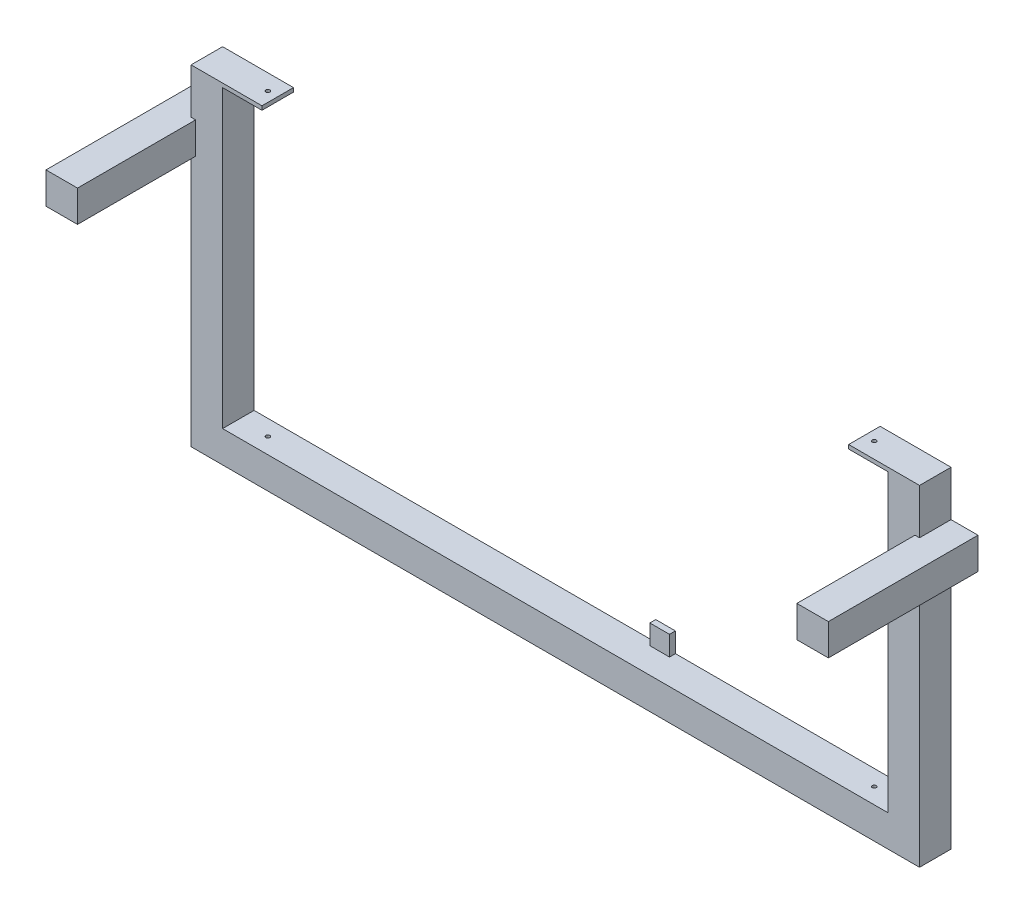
ISO-10303-21;
HEADER;
FILE_DESCRIPTION(('STEP AP214'),'2;1');
FILE_NAME('part.step','',(''),(''),'','','');
FILE_SCHEMA(('AUTOMOTIVE_DESIGN { 1 0 10303 214 1 1 1 1 }'));
ENDSEC;
DATA;
#1=APPLICATION_CONTEXT('core data for automotive mechanical design processes');
#2=APPLICATION_PROTOCOL_DEFINITION('international standard','automotive_design',2000,#1);
#3=PRODUCT_CONTEXT('',#1,'mechanical');
#4=PRODUCT('Part','Part','',(#3));
#5=PRODUCT_RELATED_PRODUCT_CATEGORY('part','',(#4));
#6=PRODUCT_DEFINITION_FORMATION('','',#4);
#7=PRODUCT_DEFINITION_CONTEXT('part definition',#1,'design');
#8=PRODUCT_DEFINITION('design','',#6,#7);
#9=PRODUCT_DEFINITION_SHAPE('','',#8);
#10=(LENGTH_UNIT() NAMED_UNIT(*) SI_UNIT(.MILLI.,.METRE.));
#11=(NAMED_UNIT(*) PLANE_ANGLE_UNIT() SI_UNIT($,.RADIAN.));
#12=(NAMED_UNIT(*) SI_UNIT($,.STERADIAN.) SOLID_ANGLE_UNIT());
#13=UNCERTAINTY_MEASURE_WITH_UNIT(LENGTH_MEASURE(1.E-05),#10,'distance_accuracy_value','');
#14=(GEOMETRIC_REPRESENTATION_CONTEXT(3) GLOBAL_UNCERTAINTY_ASSIGNED_CONTEXT((#13)) GLOBAL_UNIT_ASSIGNED_CONTEXT((#10,
#11,#12)) REPRESENTATION_CONTEXT('',''));
#15=CARTESIAN_POINT('',(0.,0.,0.));
#16=DIRECTION('',(0.,0.,1.));
#17=DIRECTION('',(1.,0.,0.));
#18=AXIS2_PLACEMENT_3D('',#15,#16,#17);
#19=CARTESIAN_POINT('',(-925.,40.0000000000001,40.));
#20=DIRECTION('',(0.,-1.,0.));
#21=DIRECTION('',(0.,0.,-1.));
#22=AXIS2_PLACEMENT_3D('',#19,#20,#21);
#23=PLANE('',#22);
#24=CARTESIAN_POINT('',(770.,40.0000000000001,0.));
#25=DIRECTION('',(0.,-1.,0.));
#26=DIRECTION('',(0.,0.,-1.));
#27=AXIS2_PLACEMENT_3D('',#24,#25,#26);
#28=CIRCLE('',#27,5.00000000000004);
#29=CARTESIAN_POINT('',(770.,40.0000000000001,-5.00000000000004));
#30=VERTEX_POINT('',#29);
#31=EDGE_CURVE('E361',#30,#30,#28,.T.);
#32=ORIENTED_EDGE('',*,*,#31,.T.);
#33=EDGE_LOOP('',(#32));
#34=FACE_BOUND('',#33,.T.);
#35=CARTESIAN_POINT('',(-770.,40.0000000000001,0.));
#36=DIRECTION('',(0.,-1.,0.));
#37=DIRECTION('',(0.,0.,-1.));
#38=AXIS2_PLACEMENT_3D('',#35,#36,#37);
#39=CIRCLE('',#38,5.00000000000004);
#40=CARTESIAN_POINT('',(-770.,40.0000000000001,-5.00000000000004));
#41=VERTEX_POINT('',#40);
#42=EDGE_CURVE('E349',#41,#41,#39,.T.);
#43=ORIENTED_EDGE('',*,*,#42,.T.);
#44=EDGE_LOOP('',(#43));
#45=FACE_BOUND('',#44,.T.);
#46=DIRECTION('',(0.,0.,-1.));
#47=VECTOR('',#46,1.);
#48=CARTESIAN_POINT('',(225.,40.0000000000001,-40.));
#49=LINE('',#48,#47);
#50=CARTESIAN_POINT('',(225.,40.0000000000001,-25.));
#51=VERTEX_POINT('',#50);
#52=CARTESIAN_POINT('',(225.,40.0000000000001,-40.));
#53=VERTEX_POINT('',#52);
#54=EDGE_CURVE('E54',#51,#53,#49,.T.);
#55=ORIENTED_EDGE('',*,*,#54,.F.);
#56=DIRECTION('',(1.,0.,0.));
#57=VECTOR('',#56,1.);
#58=CARTESIAN_POINT('',(225.,40.0000000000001,-25.));
#59=LINE('',#58,#57);
#60=CARTESIAN_POINT('',(175.,40.0000000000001,-25.));
#61=VERTEX_POINT('',#60);
#62=EDGE_CURVE('E58',#61,#51,#59,.T.);
#63=ORIENTED_EDGE('',*,*,#62,.F.);
#64=DIRECTION('',(0.,0.,1.));
#65=VECTOR('',#64,1.);
#66=CARTESIAN_POINT('',(175.,40.0000000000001,-40.));
#67=LINE('',#66,#65);
#68=CARTESIAN_POINT('',(175.,40.0000000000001,-40.));
#69=VERTEX_POINT('',#68);
#70=EDGE_CURVE('E234',#69,#61,#67,.T.);
#71=ORIENTED_EDGE('',*,*,#70,.F.);
#72=DIRECTION('',(-1.,0.,0.));
#73=VECTOR('',#72,1.);
#74=CARTESIAN_POINT('',(-925.,40.0000000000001,-40.));
#75=LINE('',#74,#73);
#76=CARTESIAN_POINT('',(-845.,40.0000000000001,-40.));
#77=VERTEX_POINT('',#76);
#78=EDGE_CURVE('E40',#69,#77,#75,.T.);
#79=ORIENTED_EDGE('',*,*,#78,.T.);
#80=DIRECTION('',(0.,0.,-1.));
#81=VECTOR('',#80,1.);
#82=CARTESIAN_POINT('',(-845.,40.0000000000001,40.));
#83=LINE('',#82,#81);
#84=CARTESIAN_POINT('',(-845.,40.0000000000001,40.));
#85=VERTEX_POINT('',#84);
#86=EDGE_CURVE('E421',#85,#77,#83,.T.);
#87=ORIENTED_EDGE('',*,*,#86,.F.);
#88=DIRECTION('',(-1.,0.,0.));
#89=VECTOR('',#88,1.);
#90=CARTESIAN_POINT('',(-925.,40.0000000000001,40.));
#91=LINE('',#90,#89);
#92=CARTESIAN_POINT('',(845.,40.0000000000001,40.));
#93=VERTEX_POINT('',#92);
#94=EDGE_CURVE('E439',#93,#85,#91,.T.);
#95=ORIENTED_EDGE('',*,*,#94,.F.);
#96=DIRECTION('',(0.,0.,1.));
#97=VECTOR('',#96,1.);
#98=CARTESIAN_POINT('',(845.,40.0000000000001,-40.));
#99=LINE('',#98,#97);
#100=CARTESIAN_POINT('',(845.,40.0000000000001,-40.));
#101=VERTEX_POINT('',#100);
#102=EDGE_CURVE('E409',#101,#93,#99,.T.);
#103=ORIENTED_EDGE('',*,*,#102,.F.);
#104=EDGE_CURVE('E232',#101,#53,#75,.T.);
#105=ORIENTED_EDGE('',*,*,#104,.T.);
#106=EDGE_LOOP('',(#55,#63,#71,#79,#87,#95,#103,#105));
#107=FACE_BOUND('',#106,.T.);
#108=ADVANCED_FACE('F36',(#34,#45,#107),#23,.F.);
#109=CARTESIAN_POINT('',(925.,40.0000000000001,40.));
#110=DIRECTION('',(-1.,0.,0.));
#111=DIRECTION('',(0.,0.,1.));
#112=AXIS2_PLACEMENT_3D('',#109,#110,#111);
#113=PLANE('',#112);
#114=DIRECTION('',(0.,1.,0.));
#115=VECTOR('',#114,1.);
#116=CARTESIAN_POINT('',(925.,40.0000000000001,40.));
#117=LINE('',#116,#115);
#118=CARTESIAN_POINT('',(925.,684.76,40.));
#119=VERTEX_POINT('',#118);
#120=CARTESIAN_POINT('',(925.,800.,40.));
#121=VERTEX_POINT('',#120);
#122=EDGE_CURVE('E450',#119,#121,#117,.T.);
#123=ORIENTED_EDGE('',*,*,#122,.F.);
#124=DIRECTION('',(0.,0.,-1.));
#125=VECTOR('',#124,1.);
#126=CARTESIAN_POINT('',(925.,684.76,40.));
#127=LINE('',#126,#125);
#128=CARTESIAN_POINT('',(925.,684.76,-40.));
#129=VERTEX_POINT('',#128);
#130=EDGE_CURVE('E293',#119,#129,#127,.T.);
#131=ORIENTED_EDGE('',*,*,#130,.T.);
#132=DIRECTION('',(0.,1.,0.));
#133=VECTOR('',#132,1.);
#134=CARTESIAN_POINT('',(925.,40.0000000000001,-40.));
#135=LINE('',#134,#133);
#136=CARTESIAN_POINT('',(925.,800.,-40.0000000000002));
#137=VERTEX_POINT('',#136);
#138=EDGE_CURVE('E527',#129,#137,#135,.T.);
#139=ORIENTED_EDGE('',*,*,#138,.T.);
#140=DIRECTION('',(0.,0.,-1.));
#141=VECTOR('',#140,1.);
#142=CARTESIAN_POINT('',(925.,800.,40.));
#143=LINE('',#142,#141);
#144=EDGE_CURVE('E393',#121,#137,#143,.T.);
#145=ORIENTED_EDGE('',*,*,#144,.F.);
#146=EDGE_LOOP('',(#123,#131,#139,#145));
#147=FACE_BOUND('',#146,.T.);
#148=ADVANCED_FACE('F525',(#147),#113,.F.);
#149=CARTESIAN_POINT('',(-925.,40.0000000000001,40.));
#150=DIRECTION('',(1.,0.,0.));
#151=DIRECTION('',(0.,0.,-1.));
#152=AXIS2_PLACEMENT_3D('',#149,#150,#151);
#153=PLANE('',#152);
#154=DIRECTION('',(0.,-1.,0.));
#155=VECTOR('',#154,1.);
#156=CARTESIAN_POINT('',(-925.,40.0000000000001,40.));
#157=LINE('',#156,#155);
#158=CARTESIAN_POINT('',(-925.,604.76,40.));
#159=VERTEX_POINT('',#158);
#160=CARTESIAN_POINT('',(-925.,-39.9999999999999,40.));
#161=VERTEX_POINT('',#160);
#162=EDGE_CURVE('E438',#159,#161,#157,.T.);
#163=ORIENTED_EDGE('',*,*,#162,.F.);
#164=DIRECTION('',(0.,0.,-1.));
#165=VECTOR('',#164,1.);
#166=CARTESIAN_POINT('',(-925.,604.76,40.));
#167=LINE('',#166,#165);
#168=CARTESIAN_POINT('',(-925.,604.76,-40.));
#169=VERTEX_POINT('',#168);
#170=EDGE_CURVE('E338',#159,#169,#167,.T.);
#171=ORIENTED_EDGE('',*,*,#170,.T.);
#172=DIRECTION('',(0.,-1.,0.));
#173=VECTOR('',#172,1.);
#174=CARTESIAN_POINT('',(-925.,40.0000000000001,-40.));
#175=LINE('',#174,#173);
#176=CARTESIAN_POINT('',(-925.,-39.9999999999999,-40.));
#177=VERTEX_POINT('',#176);
#178=EDGE_CURVE('E435',#169,#177,#175,.T.);
#179=ORIENTED_EDGE('',*,*,#178,.T.);
#180=DIRECTION('',(0.,0.,-1.));
#181=VECTOR('',#180,1.);
#182=CARTESIAN_POINT('',(-925.,-39.9999999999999,40.));
#183=LINE('',#182,#181);
#184=EDGE_CURVE('E11',#161,#177,#183,.T.);
#185=ORIENTED_EDGE('',*,*,#184,.F.);
#186=EDGE_LOOP('',(#163,#171,#179,#185));
#187=FACE_BOUND('',#186,.T.);
#188=ADVANCED_FACE('F503',(#187),#153,.F.);
#189=CARTESIAN_POINT('',(-925.,800.,-40.));
#190=VERTEX_POINT('',#189);
#191=CARTESIAN_POINT('',(-925.,684.76,-40.));
#192=VERTEX_POINT('',#191);
#193=EDGE_CURVE('E482',#190,#192,#175,.T.);
#194=ORIENTED_EDGE('',*,*,#193,.T.);
#195=DIRECTION('',(0.,0.,1.));
#196=VECTOR('',#195,1.);
#197=CARTESIAN_POINT('',(-925.,684.76,40.));
#198=LINE('',#197,#196);
#199=CARTESIAN_POINT('',(-925.,684.76,40.));
#200=VERTEX_POINT('',#199);
#201=EDGE_CURVE('E329',#192,#200,#198,.T.);
#202=ORIENTED_EDGE('',*,*,#201,.T.);
#203=CARTESIAN_POINT('',(-925.,800.,40.));
#204=VERTEX_POINT('',#203);
#205=EDGE_CURVE('E445',#204,#200,#157,.T.);
#206=ORIENTED_EDGE('',*,*,#205,.F.);
#207=DIRECTION('',(0.,0.,1.));
#208=VECTOR('',#207,1.);
#209=CARTESIAN_POINT('',(-925.,800.,-40.));
#210=LINE('',#209,#208);
#211=EDGE_CURVE('E370',#190,#204,#210,.T.);
#212=ORIENTED_EDGE('',*,*,#211,.F.);
#213=EDGE_LOOP('',(#194,#202,#206,#212));
#214=FACE_BOUND('',#213,.T.);
#215=ADVANCED_FACE('F38',(#214),#153,.F.);
#216=CARTESIAN_POINT('',(-925.,-39.9999999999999,40.));
#217=DIRECTION('',(0.,1.,0.));
#218=DIRECTION('',(0.,0.,1.));
#219=AXIS2_PLACEMENT_3D('',#216,#217,#218);
#220=PLANE('',#219);
#221=CARTESIAN_POINT('',(-770.,-39.9999999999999,0.));
#222=DIRECTION('',(0.,1.,0.));
#223=DIRECTION('',(0.,0.,1.));
#224=AXIS2_PLACEMENT_3D('',#221,#222,#223);
#225=CIRCLE('',#224,5.00000000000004);
#226=CARTESIAN_POINT('',(-770.,-39.9999999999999,5.00000000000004));
#227=VERTEX_POINT('',#226);
#228=EDGE_CURVE('E343',#227,#227,#225,.T.);
#229=ORIENTED_EDGE('',*,*,#228,.T.);
#230=EDGE_LOOP('',(#229));
#231=FACE_BOUND('',#230,.T.);
#232=CARTESIAN_POINT('',(770.,-39.9999999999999,0.));
#233=DIRECTION('',(0.,1.,0.));
#234=DIRECTION('',(0.,0.,1.));
#235=AXIS2_PLACEMENT_3D('',#232,#233,#234);
#236=CIRCLE('',#235,5.00000000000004);
#237=CARTESIAN_POINT('',(770.,-39.9999999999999,5.00000000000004));
#238=VERTEX_POINT('',#237);
#239=EDGE_CURVE('E355',#238,#238,#236,.T.);
#240=ORIENTED_EDGE('',*,*,#239,.T.);
#241=EDGE_LOOP('',(#240));
#242=FACE_BOUND('',#241,.T.);
#243=DIRECTION('',(1.,0.,0.));
#244=VECTOR('',#243,1.);
#245=CARTESIAN_POINT('',(-925.,-39.9999999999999,-40.));
#246=LINE('',#245,#244);
#247=CARTESIAN_POINT('',(925.,-39.9999999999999,-40.));
#248=VERTEX_POINT('',#247);
#249=EDGE_CURVE('E508',#177,#248,#246,.T.);
#250=ORIENTED_EDGE('',*,*,#249,.T.);
#251=DIRECTION('',(0.,0.,-1.));
#252=VECTOR('',#251,1.);
#253=CARTESIAN_POINT('',(925.,-39.9999999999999,40.));
#254=LINE('',#253,#252);
#255=CARTESIAN_POINT('',(925.,-39.9999999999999,40.));
#256=VERTEX_POINT('',#255);
#257=EDGE_CURVE('E46',#256,#248,#254,.T.);
#258=ORIENTED_EDGE('',*,*,#257,.F.);
#259=DIRECTION('',(1.,0.,0.));
#260=VECTOR('',#259,1.);
#261=CARTESIAN_POINT('',(-925.,-39.9999999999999,40.));
#262=LINE('',#261,#260);
#263=EDGE_CURVE('E448',#161,#256,#262,.T.);
#264=ORIENTED_EDGE('',*,*,#263,.F.);
#265=ORIENTED_EDGE('',*,*,#184,.T.);
#266=EDGE_LOOP('',(#250,#258,#264,#265));
#267=FACE_BOUND('',#266,.T.);
#268=ADVANCED_FACE('F507',(#231,#242,#267),#220,.F.);
#269=CARTESIAN_POINT('',(925.,604.76,-40.));
#270=VERTEX_POINT('',#269);
#271=EDGE_CURVE('E233',#248,#270,#135,.T.);
#272=ORIENTED_EDGE('',*,*,#271,.T.);
#273=DIRECTION('',(0.,0.,1.));
#274=VECTOR('',#273,1.);
#275=CARTESIAN_POINT('',(925.,604.76,40.));
#276=LINE('',#275,#274);
#277=CARTESIAN_POINT('',(925.,604.76,40.));
#278=VERTEX_POINT('',#277);
#279=EDGE_CURVE('E284',#270,#278,#276,.T.);
#280=ORIENTED_EDGE('',*,*,#279,.T.);
#281=EDGE_CURVE('E451',#256,#278,#117,.T.);
#282=ORIENTED_EDGE('',*,*,#281,.F.);
#283=ORIENTED_EDGE('',*,*,#257,.T.);
#284=EDGE_LOOP('',(#272,#280,#282,#283));
#285=FACE_BOUND('',#284,.T.);
#286=ADVANCED_FACE('F510',(#285),#113,.F.);
#287=CARTESIAN_POINT('',(-925.,-39.9999999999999,40.));
#288=DIRECTION('',(0.,0.,1.));
#289=DIRECTION('',(1.,0.,0.));
#290=AXIS2_PLACEMENT_3D('',#287,#288,#289);
#291=PLANE('',#290);
#292=DIRECTION('',(-1.,0.,0.));
#293=VECTOR('',#292,1.);
#294=CARTESIAN_POINT('',(-925.,684.76,40.));
#295=LINE('',#294,#293);
#296=CARTESIAN_POINT('',(913.5,684.76,40.));
#297=VERTEX_POINT('',#296);
#298=EDGE_CURVE('E290',#119,#297,#295,.T.);
#299=ORIENTED_EDGE('',*,*,#298,.F.);
#300=ORIENTED_EDGE('',*,*,#122,.T.);
#301=DIRECTION('',(1.,0.,0.));
#302=VECTOR('',#301,1.);
#303=CARTESIAN_POINT('',(925.,800.,40.));
#304=LINE('',#303,#302);
#305=CARTESIAN_POINT('',(745.,800.,40.));
#306=VERTEX_POINT('',#305);
#307=EDGE_CURVE('E400',#306,#121,#304,.T.);
#308=ORIENTED_EDGE('',*,*,#307,.F.);
#309=DIRECTION('',(0.,-1.,0.));
#310=VECTOR('',#309,1.);
#311=CARTESIAN_POINT('',(745.,800.,40.));
#312=LINE('',#311,#310);
#313=CARTESIAN_POINT('',(745.,790.,40.));
#314=VERTEX_POINT('',#313);
#315=EDGE_CURVE('E403',#306,#314,#312,.T.);
#316=ORIENTED_EDGE('',*,*,#315,.T.);
#317=DIRECTION('',(1.,0.,0.));
#318=VECTOR('',#317,1.);
#319=CARTESIAN_POINT('',(925.,790.,40.));
#320=LINE('',#319,#318);
#321=CARTESIAN_POINT('',(845.,790.,40.));
#322=VERTEX_POINT('',#321);
#323=EDGE_CURVE('E390',#314,#322,#320,.T.);
#324=ORIENTED_EDGE('',*,*,#323,.T.);
#325=DIRECTION('',(0.,-1.,0.));
#326=VECTOR('',#325,1.);
#327=CARTESIAN_POINT('',(845.,790.,40.));
#328=LINE('',#327,#326);
#329=EDGE_CURVE('E415',#322,#93,#328,.T.);
#330=ORIENTED_EDGE('',*,*,#329,.T.);
#331=ORIENTED_EDGE('',*,*,#94,.T.);
#332=DIRECTION('',(0.,-1.,0.));
#333=VECTOR('',#332,1.);
#334=CARTESIAN_POINT('',(-845.,790.,40.));
#335=LINE('',#334,#333);
#336=CARTESIAN_POINT('',(-845.,790.,40.));
#337=VERTEX_POINT('',#336);
#338=EDGE_CURVE('E430',#337,#85,#335,.T.);
#339=ORIENTED_EDGE('',*,*,#338,.F.);
#340=DIRECTION('',(1.,0.,0.));
#341=VECTOR('',#340,1.);
#342=CARTESIAN_POINT('',(-925.,790.,40.));
#343=LINE('',#342,#341);
#344=CARTESIAN_POINT('',(-745.,790.,40.));
#345=VERTEX_POINT('',#344);
#346=EDGE_CURVE('E364',#337,#345,#343,.T.);
#347=ORIENTED_EDGE('',*,*,#346,.T.);
#348=DIRECTION('',(0.,-1.,0.));
#349=VECTOR('',#348,1.);
#350=CARTESIAN_POINT('',(-745.,800.,40.));
#351=LINE('',#350,#349);
#352=CARTESIAN_POINT('',(-745.,800.,40.));
#353=VERTEX_POINT('',#352);
#354=EDGE_CURVE('E383',#353,#345,#351,.T.);
#355=ORIENTED_EDGE('',*,*,#354,.F.);
#356=DIRECTION('',(1.,0.,0.));
#357=VECTOR('',#356,1.);
#358=CARTESIAN_POINT('',(-925.,800.,40.));
#359=LINE('',#358,#357);
#360=EDGE_CURVE('E373',#204,#353,#359,.T.);
#361=ORIENTED_EDGE('',*,*,#360,.F.);
#362=ORIENTED_EDGE('',*,*,#205,.T.);
#363=DIRECTION('',(-1.,0.,0.));
#364=VECTOR('',#363,1.);
#365=CARTESIAN_POINT('',(-925.,684.76,40.));
#366=LINE('',#365,#364);
#367=CARTESIAN_POINT('',(-913.5,684.76,40.));
#368=VERTEX_POINT('',#367);
#369=EDGE_CURVE('E319',#368,#200,#366,.T.);
#370=ORIENTED_EDGE('',*,*,#369,.F.);
#371=DIRECTION('',(0.,1.,0.));
#372=VECTOR('',#371,1.);
#373=CARTESIAN_POINT('',(-913.5,-39.9999999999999,40.));
#374=LINE('',#373,#372);
#375=CARTESIAN_POINT('',(-913.5,604.76,40.));
#376=VERTEX_POINT('',#375);
#377=EDGE_CURVE('E332',#376,#368,#374,.T.);
#378=ORIENTED_EDGE('',*,*,#377,.F.);
#379=DIRECTION('',(1.,0.,0.));
#380=VECTOR('',#379,1.);
#381=CARTESIAN_POINT('',(-925.,604.76,40.));
#382=LINE('',#381,#380);
#383=EDGE_CURVE('E335',#159,#376,#382,.T.);
#384=ORIENTED_EDGE('',*,*,#383,.F.);
#385=ORIENTED_EDGE('',*,*,#162,.T.);
#386=ORIENTED_EDGE('',*,*,#263,.T.);
#387=ORIENTED_EDGE('',*,*,#281,.T.);
#388=DIRECTION('',(1.,0.,0.));
#389=VECTOR('',#388,1.);
#390=CARTESIAN_POINT('',(-925.,604.76,40.));
#391=LINE('',#390,#389);
#392=CARTESIAN_POINT('',(913.5,604.76,40.));
#393=VERTEX_POINT('',#392);
#394=EDGE_CURVE('E274',#393,#278,#391,.T.);
#395=ORIENTED_EDGE('',*,*,#394,.F.);
#396=DIRECTION('',(0.,-1.,0.));
#397=VECTOR('',#396,1.);
#398=CARTESIAN_POINT('',(913.5,-39.9999999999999,40.));
#399=LINE('',#398,#397);
#400=EDGE_CURVE('E287',#297,#393,#399,.T.);
#401=ORIENTED_EDGE('',*,*,#400,.F.);
#402=EDGE_LOOP('',(#299,#300,#308,#316,#324,#330,#331,#339,#347,#355,#361,#362,#370,#378,#384,
#385,#386,#387,#395,#401));
#403=FACE_BOUND('',#402,.T.);
#404=ADVANCED_FACE('F459',(#403),#291,.T.);
#405=CARTESIAN_POINT('',(-925.,-39.9999999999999,-40.));
#406=DIRECTION('',(0.,0.,1.));
#407=DIRECTION('',(1.,0.,0.));
#408=AXIS2_PLACEMENT_3D('',#405,#406,#407);
#409=PLANE('',#408);
#410=ORIENTED_EDGE('',*,*,#138,.F.);
#411=DIRECTION('',(1.,0.,0.));
#412=VECTOR('',#411,1.);
#413=CARTESIAN_POINT('',(993.5,684.76,-40.));
#414=LINE('',#413,#412);
#415=CARTESIAN_POINT('',(993.5,684.76,-40.));
#416=VERTEX_POINT('',#415);
#417=EDGE_CURVE('E245',#129,#416,#414,.T.);
#418=ORIENTED_EDGE('',*,*,#417,.T.);
#419=DIRECTION('',(0.,-1.,0.));
#420=VECTOR('',#419,1.);
#421=CARTESIAN_POINT('',(993.5,684.76,-40.));
#422=LINE('',#421,#420);
#423=CARTESIAN_POINT('',(993.5,604.76,-40.));
#424=VERTEX_POINT('',#423);
#425=EDGE_CURVE('E252',#416,#424,#422,.T.);
#426=ORIENTED_EDGE('',*,*,#425,.T.);
#427=DIRECTION('',(-1.,0.,0.));
#428=VECTOR('',#427,1.);
#429=CARTESIAN_POINT('',(993.5,604.76,-40.));
#430=LINE('',#429,#428);
#431=EDGE_CURVE('E255',#424,#270,#430,.T.);
#432=ORIENTED_EDGE('',*,*,#431,.T.);
#433=ORIENTED_EDGE('',*,*,#271,.F.);
#434=ORIENTED_EDGE('',*,*,#249,.F.);
#435=ORIENTED_EDGE('',*,*,#178,.F.);
#436=DIRECTION('',(-1.,0.,0.));
#437=VECTOR('',#436,1.);
#438=CARTESIAN_POINT('',(-993.5,604.76,-40.));
#439=LINE('',#438,#437);
#440=CARTESIAN_POINT('',(-993.5,604.76,-40.));
#441=VERTEX_POINT('',#440);
#442=EDGE_CURVE('E301',#169,#441,#439,.T.);
#443=ORIENTED_EDGE('',*,*,#442,.T.);
#444=DIRECTION('',(0.,1.,0.));
#445=VECTOR('',#444,1.);
#446=CARTESIAN_POINT('',(-993.5,684.76,-40.));
#447=LINE('',#446,#445);
#448=CARTESIAN_POINT('',(-993.5,684.76,-40.));
#449=VERTEX_POINT('',#448);
#450=EDGE_CURVE('E295',#441,#449,#447,.T.);
#451=ORIENTED_EDGE('',*,*,#450,.T.);
#452=DIRECTION('',(1.,0.,0.));
#453=VECTOR('',#452,1.);
#454=CARTESIAN_POINT('',(-993.5,684.76,-40.));
#455=LINE('',#454,#453);
#456=EDGE_CURVE('E298',#449,#192,#455,.T.);
#457=ORIENTED_EDGE('',*,*,#456,.T.);
#458=ORIENTED_EDGE('',*,*,#193,.F.);
#459=DIRECTION('',(-1.,0.,0.));
#460=VECTOR('',#459,1.);
#461=CARTESIAN_POINT('',(-925.,800.,-40.));
#462=LINE('',#461,#460);
#463=CARTESIAN_POINT('',(-745.,800.,-40.));
#464=VERTEX_POINT('',#463);
#465=EDGE_CURVE('E377',#464,#190,#462,.T.);
#466=ORIENTED_EDGE('',*,*,#465,.F.);
#467=DIRECTION('',(0.,-1.,0.));
#468=VECTOR('',#467,1.);
#469=CARTESIAN_POINT('',(-745.,800.,-40.));
#470=LINE('',#469,#468);
#471=CARTESIAN_POINT('',(-745.,790.,-40.));
#472=VERTEX_POINT('',#471);
#473=EDGE_CURVE('E380',#464,#472,#470,.T.);
#474=ORIENTED_EDGE('',*,*,#473,.T.);
#475=DIRECTION('',(-1.,0.,0.));
#476=VECTOR('',#475,1.);
#477=CARTESIAN_POINT('',(-925.,790.,-40.));
#478=LINE('',#477,#476);
#479=CARTESIAN_POINT('',(-845.,790.,-40.));
#480=VERTEX_POINT('',#479);
#481=EDGE_CURVE('E368',#472,#480,#478,.T.);
#482=ORIENTED_EDGE('',*,*,#481,.T.);
#483=DIRECTION('',(0.,-1.,0.));
#484=VECTOR('',#483,1.);
#485=CARTESIAN_POINT('',(-845.,790.,-40.));
#486=LINE('',#485,#484);
#487=EDGE_CURVE('E229',#480,#77,#486,.T.);
#488=ORIENTED_EDGE('',*,*,#487,.T.);
#489=ORIENTED_EDGE('',*,*,#78,.F.);
#490=DIRECTION('',(0.,-1.,0.));
#491=VECTOR('',#490,1.);
#492=CARTESIAN_POINT('',(175.,90.0000000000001,-40.));
#493=LINE('',#492,#491);
#494=CARTESIAN_POINT('',(175.,90.0000000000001,-40.));
#495=VERTEX_POINT('',#494);
#496=EDGE_CURVE('E226',#495,#69,#493,.T.);
#497=ORIENTED_EDGE('',*,*,#496,.F.);
#498=DIRECTION('',(-1.,0.,0.));
#499=VECTOR('',#498,1.);
#500=CARTESIAN_POINT('',(225.,90.0000000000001,-40.));
#501=LINE('',#500,#499);
#502=CARTESIAN_POINT('',(225.,90.0000000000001,-40.));
#503=VERTEX_POINT('',#502);
#504=EDGE_CURVE('E545',#503,#495,#501,.T.);
#505=ORIENTED_EDGE('',*,*,#504,.F.);
#506=DIRECTION('',(0.,-1.,0.));
#507=VECTOR('',#506,1.);
#508=CARTESIAN_POINT('',(225.,90.0000000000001,-40.));
#509=LINE('',#508,#507);
#510=EDGE_CURVE('E241',#503,#53,#509,.T.);
#511=ORIENTED_EDGE('',*,*,#510,.T.);
#512=ORIENTED_EDGE('',*,*,#104,.F.);
#513=DIRECTION('',(0.,-1.,0.));
#514=VECTOR('',#513,1.);
#515=CARTESIAN_POINT('',(845.,790.,-40.));
#516=LINE('',#515,#514);
#517=CARTESIAN_POINT('',(845.,790.,-40.));
#518=VERTEX_POINT('',#517);
#519=EDGE_CURVE('E418',#518,#101,#516,.T.);
#520=ORIENTED_EDGE('',*,*,#519,.F.);
#521=DIRECTION('',(-1.,0.,0.));
#522=VECTOR('',#521,1.);
#523=CARTESIAN_POINT('',(925.,790.,-40.0000000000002));
#524=LINE('',#523,#522);
#525=CARTESIAN_POINT('',(745.,790.,-40.0000000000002));
#526=VERTEX_POINT('',#525);
#527=EDGE_CURVE('E386',#518,#526,#524,.T.);
#528=ORIENTED_EDGE('',*,*,#527,.T.);
#529=DIRECTION('',(0.,-1.,0.));
#530=VECTOR('',#529,1.);
#531=CARTESIAN_POINT('',(745.,800.,-40.0000000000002));
#532=LINE('',#531,#530);
#533=CARTESIAN_POINT('',(745.,800.,-40.0000000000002));
#534=VERTEX_POINT('',#533);
#535=EDGE_CURVE('E406',#534,#526,#532,.T.);
#536=ORIENTED_EDGE('',*,*,#535,.F.);
#537=DIRECTION('',(-1.,0.,0.));
#538=VECTOR('',#537,1.);
#539=CARTESIAN_POINT('',(925.,800.,-40.0000000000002));
#540=LINE('',#539,#538);
#541=EDGE_CURVE('E396',#137,#534,#540,.T.);
#542=ORIENTED_EDGE('',*,*,#541,.F.);
#543=EDGE_LOOP('',(#410,#418,#426,#432,#433,#434,#435,#443,#451,#457,#458,#466,#474,#482,#488,
#489,#497,#505,#511,#512,#520,#528,#536,#542));
#544=FACE_BOUND('',#543,.T.);
#545=ADVANCED_FACE('F224',(#544),#409,.F.);
#546=CARTESIAN_POINT('',(-845.,790.,40.));
#547=DIRECTION('',(-1.,0.,0.));
#548=DIRECTION('',(0.,0.,1.));
#549=AXIS2_PLACEMENT_3D('',#546,#547,#548);
#550=PLANE('',#549);
#551=ORIENTED_EDGE('',*,*,#86,.T.);
#552=ORIENTED_EDGE('',*,*,#487,.F.);
#553=DIRECTION('',(0.,0.,-1.));
#554=VECTOR('',#553,1.);
#555=CARTESIAN_POINT('',(-845.,790.,40.));
#556=LINE('',#555,#554);
#557=EDGE_CURVE('E424',#337,#480,#556,.T.);
#558=ORIENTED_EDGE('',*,*,#557,.F.);
#559=ORIENTED_EDGE('',*,*,#338,.T.);
#560=EDGE_LOOP('',(#551,#552,#558,#559));
#561=FACE_BOUND('',#560,.T.);
#562=ADVANCED_FACE('F463',(#561),#550,.F.);
#563=CARTESIAN_POINT('',(845.,790.,-40.));
#564=DIRECTION('',(1.,0.,0.));
#565=DIRECTION('',(0.,0.,-1.));
#566=AXIS2_PLACEMENT_3D('',#563,#564,#565);
#567=PLANE('',#566);
#568=ORIENTED_EDGE('',*,*,#102,.T.);
#569=ORIENTED_EDGE('',*,*,#329,.F.);
#570=DIRECTION('',(0.,0.,1.));
#571=VECTOR('',#570,1.);
#572=CARTESIAN_POINT('',(845.,790.,-40.));
#573=LINE('',#572,#571);
#574=EDGE_CURVE('E412',#518,#322,#573,.T.);
#575=ORIENTED_EDGE('',*,*,#574,.F.);
#576=ORIENTED_EDGE('',*,*,#519,.T.);
#577=EDGE_LOOP('',(#568,#569,#575,#576));
#578=FACE_BOUND('',#577,.T.);
#579=ADVANCED_FACE('F543',(#578),#567,.F.);
#580=CARTESIAN_POINT('',(925.,790.,40.));
#581=DIRECTION('',(0.,1.,0.));
#582=DIRECTION('',(0.,0.,1.));
#583=AXIS2_PLACEMENT_3D('',#580,#581,#582);
#584=PLANE('',#583);
#585=CARTESIAN_POINT('',(770.,790.,0.));
#586=DIRECTION('',(0.,1.,0.));
#587=DIRECTION('',(0.,0.,1.));
#588=AXIS2_PLACEMENT_3D('',#585,#586,#587);
#589=CIRCLE('',#588,5.00000000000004);
#590=CARTESIAN_POINT('',(770.,790.,5.00000000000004));
#591=VERTEX_POINT('',#590);
#592=EDGE_CURVE('E358',#591,#591,#589,.T.);
#593=ORIENTED_EDGE('',*,*,#592,.T.);
#594=EDGE_LOOP('',(#593));
#595=FACE_BOUND('',#594,.T.);
#596=ORIENTED_EDGE('',*,*,#527,.F.);
#597=ORIENTED_EDGE('',*,*,#574,.T.);
#598=ORIENTED_EDGE('',*,*,#323,.F.);
#599=DIRECTION('',(0.,0.,1.));
#600=VECTOR('',#599,1.);
#601=CARTESIAN_POINT('',(745.,790.,40.));
#602=LINE('',#601,#600);
#603=EDGE_CURVE('E388',#526,#314,#602,.T.);
#604=ORIENTED_EDGE('',*,*,#603,.F.);
#605=EDGE_LOOP('',(#596,#597,#598,#604));
#606=FACE_BOUND('',#605,.T.);
#607=ADVANCED_FACE('F540',(#595,#606),#584,.F.);
#608=CARTESIAN_POINT('',(745.,800.,40.));
#609=DIRECTION('',(1.,0.,0.));
#610=DIRECTION('',(0.,0.,-1.));
#611=AXIS2_PLACEMENT_3D('',#608,#609,#610);
#612=PLANE('',#611);
#613=ORIENTED_EDGE('',*,*,#603,.T.);
#614=ORIENTED_EDGE('',*,*,#315,.F.);
#615=DIRECTION('',(0.,0.,1.));
#616=VECTOR('',#615,1.);
#617=CARTESIAN_POINT('',(745.,800.,40.));
#618=LINE('',#617,#616);
#619=EDGE_CURVE('E398',#534,#306,#618,.T.);
#620=ORIENTED_EDGE('',*,*,#619,.F.);
#621=ORIENTED_EDGE('',*,*,#535,.T.);
#622=EDGE_LOOP('',(#613,#614,#620,#621));
#623=FACE_BOUND('',#622,.T.);
#624=ADVANCED_FACE('F620',(#623),#612,.F.);
#625=CARTESIAN_POINT('',(925.,800.,40.));
#626=DIRECTION('',(0.,1.,0.));
#627=DIRECTION('',(0.,0.,1.));
#628=AXIS2_PLACEMENT_3D('',#625,#626,#627);
#629=PLANE('',#628);
#630=CARTESIAN_POINT('',(770.,800.,0.));
#631=DIRECTION('',(0.,1.,0.));
#632=DIRECTION('',(0.,0.,1.));
#633=AXIS2_PLACEMENT_3D('',#630,#631,#632);
#634=CIRCLE('',#633,5.00000000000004);
#635=CARTESIAN_POINT('',(770.,800.,5.00000000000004));
#636=VERTEX_POINT('',#635);
#637=EDGE_CURVE('E352',#636,#636,#634,.T.);
#638=ORIENTED_EDGE('',*,*,#637,.F.);
#639=EDGE_LOOP('',(#638));
#640=FACE_BOUND('',#639,.T.);
#641=ORIENTED_EDGE('',*,*,#144,.T.);
#642=ORIENTED_EDGE('',*,*,#541,.T.);
#643=ORIENTED_EDGE('',*,*,#619,.T.);
#644=ORIENTED_EDGE('',*,*,#307,.T.);
#645=EDGE_LOOP('',(#641,#642,#643,#644));
#646=FACE_BOUND('',#645,.T.);
#647=ADVANCED_FACE('F532',(#640,#646),#629,.T.);
#648=CARTESIAN_POINT('',(-925.,790.,40.));
#649=DIRECTION('',(0.,1.,0.));
#650=DIRECTION('',(0.,0.,1.));
#651=AXIS2_PLACEMENT_3D('',#648,#649,#650);
#652=PLANE('',#651);
#653=CARTESIAN_POINT('',(-770.,790.,0.));
#654=DIRECTION('',(0.,1.,0.));
#655=DIRECTION('',(0.,0.,1.));
#656=AXIS2_PLACEMENT_3D('',#653,#654,#655);
#657=CIRCLE('',#656,5.00000000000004);
#658=CARTESIAN_POINT('',(-770.,790.,5.00000000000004));
#659=VERTEX_POINT('',#658);
#660=EDGE_CURVE('E346',#659,#659,#657,.T.);
#661=ORIENTED_EDGE('',*,*,#660,.T.);
#662=EDGE_LOOP('',(#661));
#663=FACE_BOUND('',#662,.T.);
#664=ORIENTED_EDGE('',*,*,#346,.F.);
#665=ORIENTED_EDGE('',*,*,#557,.T.);
#666=ORIENTED_EDGE('',*,*,#481,.F.);
#667=DIRECTION('',(0.,0.,-1.));
#668=VECTOR('',#667,1.);
#669=CARTESIAN_POINT('',(-745.,790.,-40.));
#670=LINE('',#669,#668);
#671=EDGE_CURVE('E366',#345,#472,#670,.T.);
#672=ORIENTED_EDGE('',*,*,#671,.F.);
#673=EDGE_LOOP('',(#664,#665,#666,#672));
#674=FACE_BOUND('',#673,.T.);
#675=ADVANCED_FACE('F469',(#663,#674),#652,.F.);
#676=CARTESIAN_POINT('',(-745.,800.,-40.));
#677=DIRECTION('',(-1.,0.,0.));
#678=DIRECTION('',(0.,0.,1.));
#679=AXIS2_PLACEMENT_3D('',#676,#677,#678);
#680=PLANE('',#679);
#681=ORIENTED_EDGE('',*,*,#671,.T.);
#682=ORIENTED_EDGE('',*,*,#473,.F.);
#683=DIRECTION('',(0.,0.,-1.));
#684=VECTOR('',#683,1.);
#685=CARTESIAN_POINT('',(-745.,800.,-40.));
#686=LINE('',#685,#684);
#687=EDGE_CURVE('E375',#353,#464,#686,.T.);
#688=ORIENTED_EDGE('',*,*,#687,.F.);
#689=ORIENTED_EDGE('',*,*,#354,.T.);
#690=EDGE_LOOP('',(#681,#682,#688,#689));
#691=FACE_BOUND('',#690,.T.);
#692=ADVANCED_FACE('F474',(#691),#680,.F.);
#693=CARTESIAN_POINT('',(-925.,800.,40.));
#694=DIRECTION('',(0.,1.,0.));
#695=DIRECTION('',(0.,0.,1.));
#696=AXIS2_PLACEMENT_3D('',#693,#694,#695);
#697=PLANE('',#696);
#698=CARTESIAN_POINT('',(-770.,800.,0.));
#699=DIRECTION('',(0.,1.,0.));
#700=DIRECTION('',(0.,0.,1.));
#701=AXIS2_PLACEMENT_3D('',#698,#699,#700);
#702=CIRCLE('',#701,5.00000000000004);
#703=CARTESIAN_POINT('',(-770.,800.,5.00000000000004));
#704=VERTEX_POINT('',#703);
#705=EDGE_CURVE('E340',#704,#704,#702,.T.);
#706=ORIENTED_EDGE('',*,*,#705,.F.);
#707=EDGE_LOOP('',(#706));
#708=FACE_BOUND('',#707,.T.);
#709=ORIENTED_EDGE('',*,*,#211,.T.);
#710=ORIENTED_EDGE('',*,*,#360,.T.);
#711=ORIENTED_EDGE('',*,*,#687,.T.);
#712=ORIENTED_EDGE('',*,*,#465,.T.);
#713=EDGE_LOOP('',(#709,#710,#711,#712));
#714=FACE_BOUND('',#713,.T.);
#715=ADVANCED_FACE('F478',(#708,#714),#697,.T.);
#716=CARTESIAN_POINT('',(770.,-39.9999999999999,0.));
#717=DIRECTION('',(0.,1.,0.));
#718=DIRECTION('',(0.,0.,1.));
#719=AXIS2_PLACEMENT_3D('',#716,#717,#718);
#720=CYLINDRICAL_SURFACE('',#719,5.00000000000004);
#721=ORIENTED_EDGE('',*,*,#637,.T.);
#722=EDGE_LOOP('',(#721));
#723=FACE_BOUND('',#722,.T.);
#724=ORIENTED_EDGE('',*,*,#592,.F.);
#725=EDGE_LOOP('',(#724));
#726=FACE_BOUND('',#725,.T.);
#727=ADVANCED_FACE('F597',(#723,#726),#720,.F.);
#728=ORIENTED_EDGE('',*,*,#239,.F.);
#729=EDGE_LOOP('',(#728));
#730=FACE_BOUND('',#729,.T.);
#731=ORIENTED_EDGE('',*,*,#31,.F.);
#732=EDGE_LOOP('',(#731));
#733=FACE_BOUND('',#732,.T.);
#734=ADVANCED_FACE('F593',(#730,#733),#720,.F.);
#735=CARTESIAN_POINT('',(-770.,-39.9999999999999,0.));
#736=DIRECTION('',(0.,1.,0.));
#737=DIRECTION('',(0.,0.,1.));
#738=AXIS2_PLACEMENT_3D('',#735,#736,#737);
#739=CYLINDRICAL_SURFACE('',#738,5.00000000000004);
#740=ORIENTED_EDGE('',*,*,#705,.T.);
#741=EDGE_LOOP('',(#740));
#742=FACE_BOUND('',#741,.T.);
#743=ORIENTED_EDGE('',*,*,#660,.F.);
#744=EDGE_LOOP('',(#743));
#745=FACE_BOUND('',#744,.T.);
#746=ADVANCED_FACE('F596',(#742,#745),#739,.F.);
#747=ORIENTED_EDGE('',*,*,#228,.F.);
#748=EDGE_LOOP('',(#747));
#749=FACE_BOUND('',#748,.T.);
#750=ORIENTED_EDGE('',*,*,#42,.F.);
#751=EDGE_LOOP('',(#750));
#752=FACE_BOUND('',#751,.T.);
#753=ADVANCED_FACE('F604',(#749,#752),#739,.F.);
#754=CARTESIAN_POINT('',(-993.5,604.76,340.));
#755=DIRECTION('',(0.,-1.,0.));
#756=DIRECTION('',(0.,0.,-1.));
#757=AXIS2_PLACEMENT_3D('',#754,#755,#756);
#758=PLANE('',#757);
#759=ORIENTED_EDGE('',*,*,#170,.F.);
#760=ORIENTED_EDGE('',*,*,#383,.T.);
#761=DIRECTION('',(0.,0.,-1.));
#762=VECTOR('',#761,1.);
#763=CARTESIAN_POINT('',(-913.5,604.76,340.));
#764=LINE('',#763,#762);
#765=CARTESIAN_POINT('',(-913.5,604.76,340.));
#766=VERTEX_POINT('',#765);
#767=EDGE_CURVE('E320',#766,#376,#764,.T.);
#768=ORIENTED_EDGE('',*,*,#767,.F.);
#769=DIRECTION('',(-1.,0.,0.));
#770=VECTOR('',#769,1.);
#771=CARTESIAN_POINT('',(-993.5,604.76,340.));
#772=LINE('',#771,#770);
#773=CARTESIAN_POINT('',(-993.5,604.76,340.));
#774=VERTEX_POINT('',#773);
#775=EDGE_CURVE('E312',#766,#774,#772,.T.);
#776=ORIENTED_EDGE('',*,*,#775,.T.);
#777=DIRECTION('',(0.,0.,-1.));
#778=VECTOR('',#777,1.);
#779=CARTESIAN_POINT('',(-993.5,604.76,340.));
#780=LINE('',#779,#778);
#781=EDGE_CURVE('E316',#774,#441,#780,.T.);
#782=ORIENTED_EDGE('',*,*,#781,.T.);
#783=ORIENTED_EDGE('',*,*,#442,.F.);
#784=EDGE_LOOP('',(#759,#760,#768,#776,#782,#783));
#785=FACE_BOUND('',#784,.T.);
#786=ADVANCED_FACE('F496',(#785),#758,.T.);
#787=CARTESIAN_POINT('',(-993.5,684.76,340.));
#788=DIRECTION('',(0.,1.,0.));
#789=DIRECTION('',(0.,0.,1.));
#790=AXIS2_PLACEMENT_3D('',#787,#788,#789);
#791=PLANE('',#790);
#792=ORIENTED_EDGE('',*,*,#201,.F.);
#793=ORIENTED_EDGE('',*,*,#456,.F.);
#794=DIRECTION('',(0.,0.,-1.));
#795=VECTOR('',#794,1.);
#796=CARTESIAN_POINT('',(-993.5,684.76,340.));
#797=LINE('',#796,#795);
#798=CARTESIAN_POINT('',(-993.5,684.76,340.));
#799=VERTEX_POINT('',#798);
#800=EDGE_CURVE('E315',#799,#449,#797,.T.);
#801=ORIENTED_EDGE('',*,*,#800,.F.);
#802=DIRECTION('',(1.,0.,0.));
#803=VECTOR('',#802,1.);
#804=CARTESIAN_POINT('',(-993.5,684.76,340.));
#805=LINE('',#804,#803);
#806=CARTESIAN_POINT('',(-913.5,684.76,340.));
#807=VERTEX_POINT('',#806);
#808=EDGE_CURVE('E306',#799,#807,#805,.T.);
#809=ORIENTED_EDGE('',*,*,#808,.T.);
#810=DIRECTION('',(0.,0.,-1.));
#811=VECTOR('',#810,1.);
#812=CARTESIAN_POINT('',(-913.5,684.76,340.));
#813=LINE('',#812,#811);
#814=EDGE_CURVE('E323',#807,#368,#813,.T.);
#815=ORIENTED_EDGE('',*,*,#814,.T.);
#816=ORIENTED_EDGE('',*,*,#369,.T.);
#817=EDGE_LOOP('',(#792,#793,#801,#809,#815,#816));
#818=FACE_BOUND('',#817,.T.);
#819=ADVANCED_FACE('F485',(#818),#791,.T.);
#820=CARTESIAN_POINT('',(-993.5,684.76,340.));
#821=DIRECTION('',(-1.,0.,0.));
#822=DIRECTION('',(0.,0.,1.));
#823=AXIS2_PLACEMENT_3D('',#820,#821,#822);
#824=PLANE('',#823);
#825=ORIENTED_EDGE('',*,*,#450,.F.);
#826=ORIENTED_EDGE('',*,*,#781,.F.);
#827=DIRECTION('',(0.,1.,0.));
#828=VECTOR('',#827,1.);
#829=CARTESIAN_POINT('',(-993.5,684.76,340.));
#830=LINE('',#829,#828);
#831=EDGE_CURVE('E303',#774,#799,#830,.T.);
#832=ORIENTED_EDGE('',*,*,#831,.T.);
#833=ORIENTED_EDGE('',*,*,#800,.T.);
#834=EDGE_LOOP('',(#825,#826,#832,#833));
#835=FACE_BOUND('',#834,.T.);
#836=ADVANCED_FACE('F808',(#835),#824,.T.);
#837=CARTESIAN_POINT('',(-913.5,684.76,340.));
#838=DIRECTION('',(1.,0.,0.));
#839=DIRECTION('',(0.,0.,-1.));
#840=AXIS2_PLACEMENT_3D('',#837,#838,#839);
#841=PLANE('',#840);
#842=ORIENTED_EDGE('',*,*,#767,.T.);
#843=ORIENTED_EDGE('',*,*,#377,.T.);
#844=ORIENTED_EDGE('',*,*,#814,.F.);
#845=DIRECTION('',(0.,-1.,0.));
#846=VECTOR('',#845,1.);
#847=CARTESIAN_POINT('',(-913.5,684.76,340.));
#848=LINE('',#847,#846);
#849=EDGE_CURVE('E309',#807,#766,#848,.T.);
#850=ORIENTED_EDGE('',*,*,#849,.T.);
#851=EDGE_LOOP('',(#842,#843,#844,#850));
#852=FACE_BOUND('',#851,.T.);
#853=ADVANCED_FACE('F489',(#852),#841,.T.);
#854=CARTESIAN_POINT('',(-993.5,604.76,340.));
#855=DIRECTION('',(0.,0.,1.));
#856=DIRECTION('',(1.,0.,0.));
#857=AXIS2_PLACEMENT_3D('',#854,#855,#856);
#858=PLANE('',#857);
#859=ORIENTED_EDGE('',*,*,#831,.F.);
#860=ORIENTED_EDGE('',*,*,#775,.F.);
#861=ORIENTED_EDGE('',*,*,#849,.F.);
#862=ORIENTED_EDGE('',*,*,#808,.F.);
#863=EDGE_LOOP('',(#859,#860,#861,#862));
#864=FACE_BOUND('',#863,.T.);
#865=ADVANCED_FACE('F493',(#864),#858,.T.);
#866=CARTESIAN_POINT('',(993.5,684.76,340.));
#867=DIRECTION('',(0.,1.,0.));
#868=DIRECTION('',(0.,0.,1.));
#869=AXIS2_PLACEMENT_3D('',#866,#867,#868);
#870=PLANE('',#869);
#871=ORIENTED_EDGE('',*,*,#130,.F.);
#872=ORIENTED_EDGE('',*,*,#298,.T.);
#873=DIRECTION('',(0.,0.,-1.));
#874=VECTOR('',#873,1.);
#875=CARTESIAN_POINT('',(913.5,684.76,340.));
#876=LINE('',#875,#874);
#877=CARTESIAN_POINT('',(913.5,684.76,340.));
#878=VERTEX_POINT('',#877);
#879=EDGE_CURVE('E271',#878,#297,#876,.T.);
#880=ORIENTED_EDGE('',*,*,#879,.F.);
#881=DIRECTION('',(1.,0.,0.));
#882=VECTOR('',#881,1.);
#883=CARTESIAN_POINT('',(993.5,684.76,340.));
#884=LINE('',#883,#882);
#885=CARTESIAN_POINT('',(993.5,684.76,340.));
#886=VERTEX_POINT('',#885);
#887=EDGE_CURVE('E258',#878,#886,#884,.T.);
#888=ORIENTED_EDGE('',*,*,#887,.T.);
#889=DIRECTION('',(0.,0.,-1.));
#890=VECTOR('',#889,1.);
#891=CARTESIAN_POINT('',(993.5,684.76,340.));
#892=LINE('',#891,#890);
#893=EDGE_CURVE('E270',#886,#416,#892,.T.);
#894=ORIENTED_EDGE('',*,*,#893,.T.);
#895=ORIENTED_EDGE('',*,*,#417,.F.);
#896=EDGE_LOOP('',(#871,#872,#880,#888,#894,#895));
#897=FACE_BOUND('',#896,.T.);
#898=ADVANCED_FACE('F521',(#897),#870,.T.);
#899=CARTESIAN_POINT('',(993.5,604.76,340.));
#900=DIRECTION('',(0.,-1.,0.));
#901=DIRECTION('',(0.,0.,-1.));
#902=AXIS2_PLACEMENT_3D('',#899,#900,#901);
#903=PLANE('',#902);
#904=ORIENTED_EDGE('',*,*,#279,.F.);
#905=ORIENTED_EDGE('',*,*,#431,.F.);
#906=DIRECTION('',(0.,0.,-1.));
#907=VECTOR('',#906,1.);
#908=CARTESIAN_POINT('',(993.5,604.76,340.));
#909=LINE('',#908,#907);
#910=CARTESIAN_POINT('',(993.5,604.76,340.));
#911=VERTEX_POINT('',#910);
#912=EDGE_CURVE('E278',#911,#424,#909,.T.);
#913=ORIENTED_EDGE('',*,*,#912,.F.);
#914=DIRECTION('',(-1.,0.,0.));
#915=VECTOR('',#914,1.);
#916=CARTESIAN_POINT('',(993.5,604.76,340.));
#917=LINE('',#916,#915);
#918=CARTESIAN_POINT('',(913.5,604.76,340.));
#919=VERTEX_POINT('',#918);
#920=EDGE_CURVE('E264',#911,#919,#917,.T.);
#921=ORIENTED_EDGE('',*,*,#920,.T.);
#922=DIRECTION('',(0.,0.,-1.));
#923=VECTOR('',#922,1.);
#924=CARTESIAN_POINT('',(913.5,604.76,340.));
#925=LINE('',#924,#923);
#926=EDGE_CURVE('E275',#919,#393,#925,.T.);
#927=ORIENTED_EDGE('',*,*,#926,.T.);
#928=ORIENTED_EDGE('',*,*,#394,.T.);
#929=EDGE_LOOP('',(#904,#905,#913,#921,#927,#928));
#930=FACE_BOUND('',#929,.T.);
#931=ADVANCED_FACE('F513',(#930),#903,.T.);
#932=CARTESIAN_POINT('',(913.5,684.76,340.));
#933=DIRECTION('',(-1.,0.,0.));
#934=DIRECTION('',(0.,0.,1.));
#935=AXIS2_PLACEMENT_3D('',#932,#933,#934);
#936=PLANE('',#935);
#937=ORIENTED_EDGE('',*,*,#879,.T.);
#938=ORIENTED_EDGE('',*,*,#400,.T.);
#939=ORIENTED_EDGE('',*,*,#926,.F.);
#940=DIRECTION('',(0.,1.,0.));
#941=VECTOR('',#940,1.);
#942=CARTESIAN_POINT('',(913.5,684.76,340.));
#943=LINE('',#942,#941);
#944=EDGE_CURVE('E267',#919,#878,#943,.T.);
#945=ORIENTED_EDGE('',*,*,#944,.T.);
#946=EDGE_LOOP('',(#937,#938,#939,#945));
#947=FACE_BOUND('',#946,.T.);
#948=ADVANCED_FACE('F517',(#947),#936,.T.);
#949=CARTESIAN_POINT('',(993.5,684.76,340.));
#950=DIRECTION('',(1.,0.,0.));
#951=DIRECTION('',(0.,0.,-1.));
#952=AXIS2_PLACEMENT_3D('',#949,#950,#951);
#953=PLANE('',#952);
#954=ORIENTED_EDGE('',*,*,#425,.F.);
#955=ORIENTED_EDGE('',*,*,#893,.F.);
#956=DIRECTION('',(0.,-1.,0.));
#957=VECTOR('',#956,1.);
#958=CARTESIAN_POINT('',(993.5,684.76,340.));
#959=LINE('',#958,#957);
#960=EDGE_CURVE('E261',#886,#911,#959,.T.);
#961=ORIENTED_EDGE('',*,*,#960,.T.);
#962=ORIENTED_EDGE('',*,*,#912,.T.);
#963=EDGE_LOOP('',(#954,#955,#961,#962));
#964=FACE_BOUND('',#963,.T.);
#965=ADVANCED_FACE('F851',(#964),#953,.T.);
#966=CARTESIAN_POINT('',(913.5,684.76,340.));
#967=DIRECTION('',(0.,0.,1.));
#968=DIRECTION('',(1.,0.,0.));
#969=AXIS2_PLACEMENT_3D('',#966,#967,#968);
#970=PLANE('',#969);
#971=ORIENTED_EDGE('',*,*,#887,.F.);
#972=ORIENTED_EDGE('',*,*,#944,.F.);
#973=ORIENTED_EDGE('',*,*,#920,.F.);
#974=ORIENTED_EDGE('',*,*,#960,.F.);
#975=EDGE_LOOP('',(#971,#972,#973,#974));
#976=FACE_BOUND('',#975,.T.);
#977=ADVANCED_FACE('F859',(#976),#970,.T.);
#978=CARTESIAN_POINT('',(225.,90.0000000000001,-40.));
#979=DIRECTION('',(-1.,0.,0.));
#980=DIRECTION('',(0.,0.,1.));
#981=AXIS2_PLACEMENT_3D('',#978,#979,#980);
#982=PLANE('',#981);
#983=ORIENTED_EDGE('',*,*,#54,.T.);
#984=ORIENTED_EDGE('',*,*,#510,.F.);
#985=DIRECTION('',(0.,0.,-1.));
#986=VECTOR('',#985,1.);
#987=CARTESIAN_POINT('',(225.,90.0000000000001,-40.));
#988=LINE('',#987,#986);
#989=CARTESIAN_POINT('',(225.,90.0000000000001,-25.));
#990=VERTEX_POINT('',#989);
#991=EDGE_CURVE('E555',#990,#503,#988,.T.);
#992=ORIENTED_EDGE('',*,*,#991,.F.);
#993=DIRECTION('',(0.,-1.,0.));
#994=VECTOR('',#993,1.);
#995=CARTESIAN_POINT('',(225.,90.0000000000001,-25.));
#996=LINE('',#995,#994);
#997=EDGE_CURVE('E247',#990,#51,#996,.T.);
#998=ORIENTED_EDGE('',*,*,#997,.T.);
#999=EDGE_LOOP('',(#983,#984,#992,#998));
#1000=FACE_BOUND('',#999,.T.);
#1001=ADVANCED_FACE('F550',(#1000),#982,.F.);
#1002=CARTESIAN_POINT('',(175.,90.0000000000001,-40.));
#1003=DIRECTION('',(1.,0.,0.));
#1004=DIRECTION('',(0.,0.,-1.));
#1005=AXIS2_PLACEMENT_3D('',#1002,#1003,#1004);
#1006=PLANE('',#1005);
#1007=ORIENTED_EDGE('',*,*,#70,.T.);
#1008=DIRECTION('',(0.,-1.,0.));
#1009=VECTOR('',#1008,1.);
#1010=CARTESIAN_POINT('',(175.,90.0000000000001,-25.));
#1011=LINE('',#1010,#1009);
#1012=CARTESIAN_POINT('',(175.,90.0000000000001,-25.));
#1013=VERTEX_POINT('',#1012);
#1014=EDGE_CURVE('E242',#1013,#61,#1011,.T.);
#1015=ORIENTED_EDGE('',*,*,#1014,.F.);
#1016=DIRECTION('',(0.,0.,1.));
#1017=VECTOR('',#1016,1.);
#1018=CARTESIAN_POINT('',(175.,90.0000000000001,-40.));
#1019=LINE('',#1018,#1017);
#1020=EDGE_CURVE('E240',#495,#1013,#1019,.T.);
#1021=ORIENTED_EDGE('',*,*,#1020,.F.);
#1022=ORIENTED_EDGE('',*,*,#496,.T.);
#1023=EDGE_LOOP('',(#1007,#1015,#1021,#1022));
#1024=FACE_BOUND('',#1023,.T.);
#1025=ADVANCED_FACE('F239',(#1024),#1006,.F.);
#1026=CARTESIAN_POINT('',(225.,90.0000000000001,-25.));
#1027=DIRECTION('',(0.,0.,-1.));
#1028=DIRECTION('',(-1.,0.,0.));
#1029=AXIS2_PLACEMENT_3D('',#1026,#1027,#1028);
#1030=PLANE('',#1029);
#1031=ORIENTED_EDGE('',*,*,#62,.T.);
#1032=ORIENTED_EDGE('',*,*,#997,.F.);
#1033=DIRECTION('',(1.,0.,0.));
#1034=VECTOR('',#1033,1.);
#1035=CARTESIAN_POINT('',(225.,90.0000000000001,-25.));
#1036=LINE('',#1035,#1034);
#1037=EDGE_CURVE('E559',#1013,#990,#1036,.T.);
#1038=ORIENTED_EDGE('',*,*,#1037,.F.);
#1039=ORIENTED_EDGE('',*,*,#1014,.T.);
#1040=EDGE_LOOP('',(#1031,#1032,#1038,#1039));
#1041=FACE_BOUND('',#1040,.T.);
#1042=ADVANCED_FACE('F564',(#1041),#1030,.F.);
#1043=CARTESIAN_POINT('',(225.,90.0000000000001,-25.));
#1044=DIRECTION('',(0.,-1.,0.));
#1045=DIRECTION('',(0.,0.,-1.));
#1046=AXIS2_PLACEMENT_3D('',#1043,#1044,#1045);
#1047=PLANE('',#1046);
#1048=ORIENTED_EDGE('',*,*,#991,.T.);
#1049=ORIENTED_EDGE('',*,*,#504,.T.);
#1050=ORIENTED_EDGE('',*,*,#1020,.T.);
#1051=ORIENTED_EDGE('',*,*,#1037,.T.);
#1052=EDGE_LOOP('',(#1048,#1049,#1050,#1051));
#1053=FACE_BOUND('',#1052,.T.);
#1054=ADVANCED_FACE('F562',(#1053),#1047,.F.);
#1055=CLOSED_SHELL('',(#108,#148,#188,#215,#268,#286,#404,#545,#562,#579,#607,#624,#647,#675,
#692,#715,#727,#734,#746,#753,#786,#819,#836,#853,#865,#898,#931,#948,#965,#977,#1001,#1025,
#1042,#1054));
#1056=MANIFOLD_SOLID_BREP('B2',#1055);
#1057=ADVANCED_BREP_SHAPE_REPRESENTATION('',(#18,#1056),#14);
#1058=SHAPE_DEFINITION_REPRESENTATION(#9,#1057);
ENDSEC;
END-ISO-10303-21;
